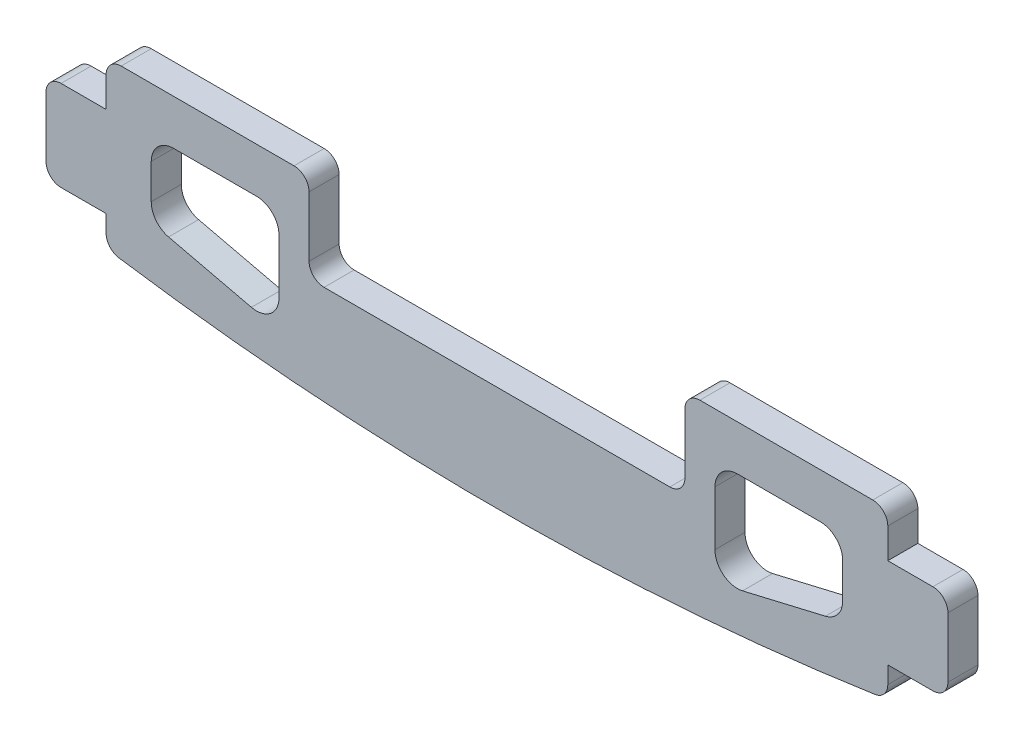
from build123d import *

# Parameters (mm, degrees)
RESSALTO_EXTRUS_O1_DEPTH = 2


with BuildPart() as part:
    # Esbo_o1 → Ressalto-extrus_o1 (new body)
    with BuildSketch(Plane.XY):
        with BuildLine():
            Line((-11.5, 0), (11.5, 0))
            ThreePointArc((11.5, 0), (12.207106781, 0.292893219), (12.5, 1))
            Line((12.5, 1), (12.5, 5))
            ThreePointArc((12.5, 5), (12.792893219, 5.707106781), (13.5, 6))
            Line((13.5, 6), (25, 6))
            ThreePointArc((25, 6), (25.707106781, 5.707106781), (26, 5))
            Line((26, 5), (26, 3))
            Line((26, 3), (29, 3))
            ThreePointArc((29, 3), (29.707106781, 2.707106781), (30, 2))
            Line((30, 2), (30, -2))
            ThreePointArc((30, -2), (29.707106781, -2.707106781), (29, -3))
            Line((29, -3), (26, -3))
            Line((26, -3), (26, -4.140659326))
            ThreePointArc((26, -4.140659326), (25.757604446, -4.793373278), (25.147928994, -5.12965731))
            ThreePointArc((25.147928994, -5.12965731), (12.608692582, -6.531769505), (0, -7))
            ThreePointArc((0, -7), (-12.608692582, -6.531769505), (-25.147928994, -5.12965731))
            ThreePointArc((-25.147928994, -5.12965731), (-25.757604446, -4.793373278), (-26, -4.140659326))
            Line((-26, -4.140659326), (-26, -3))
            Line((-26, -3), (-29, -3))
            ThreePointArc((-29, -3), (-29.707106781, -2.707106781), (-30, -2))
            Line((-30, -2), (-30, 2))
            ThreePointArc((-30, 2), (-29.707106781, 2.707106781), (-29, 3))
            Line((-29, 3), (-26, 3))
            Line((-26, 3), (-26, 5))
            ThreePointArc((-26, 5), (-25.707106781, 5.707106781), (-25, 6))
            Line((-25, 6), (-13.5, 6))
            ThreePointArc((-13.5, 6), (-12.792893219, 5.707106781), (-12.5, 5))
            Line((-12.5, 5), (-12.5, 1))
            ThreePointArc((-12.5, 1), (-12.207106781, 0.292893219), (-11.5, 0))
        make_face()
        with BuildLine():
            Line((15.99403097, 3), (21.50596903, 3))
            ThreePointArc((21.50596903, 3), (22.56240846, 2.56240846), (23, 1.50596903))
            Line((23, 1.50596903), (23, -0.816705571))
            ThreePointArc((23, -0.816705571), (22.677159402, -1.744305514), (21.848160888, -2.271020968))
            Line((21.848160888, -2.271020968), (16.336222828, -3.56794757))
            ThreePointArc((16.336222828, -3.56794757), (15.066431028, -3.284822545), (14.5, -2.113632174))
            Line((14.5, -2.113632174), (14.5, 1.50596903))
            ThreePointArc((14.5, 1.50596903), (14.93759154, 2.56240846), (15.99403097, 3))
        make_face(mode=Mode.SUBTRACT)
        with BuildLine():
            Line((-14.5, -2.113632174), (-14.5, 1.50596903))
            ThreePointArc((-14.5, 1.50596903), (-14.93759154, 2.56240846), (-15.99403097, 3))
            Line((-15.99403097, 3), (-21.50596903, 3))
            ThreePointArc((-21.50596903, 3), (-22.56240846, 2.56240846), (-23, 1.50596903))
            Line((-23, 1.50596903), (-23, -0.816705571))
            ThreePointArc((-23, -0.816705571), (-22.677159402, -1.744305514), (-21.848160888, -2.271020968))
            Line((-21.848160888, -2.271020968), (-16.336222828, -3.56794757))
            ThreePointArc((-16.336222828, -3.56794757), (-15.066431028, -3.284822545), (-14.5, -2.113632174))
        make_face(mode=Mode.SUBTRACT)
    extrude(amount=RESSALTO_EXTRUS_O1_DEPTH)


solid = part.part
